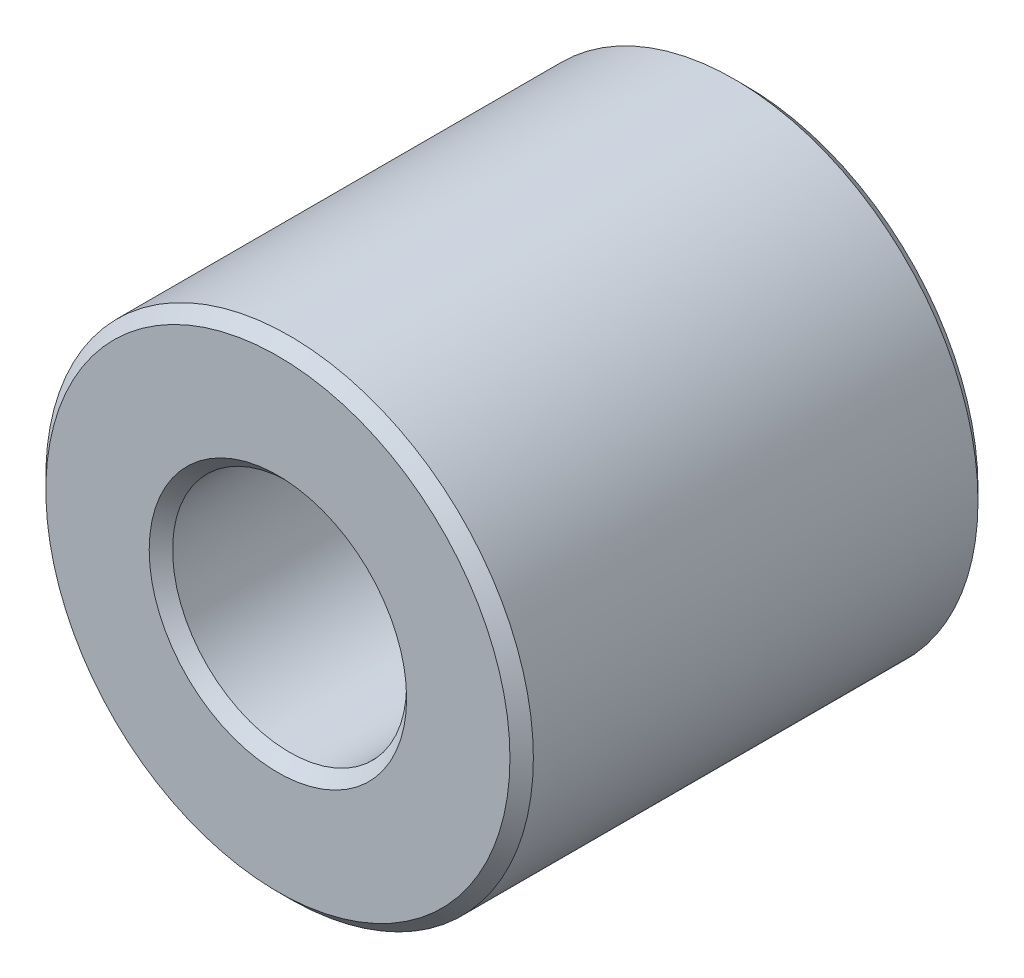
from build123d import *

# Parameters (mm, degrees)
SKETCH1_R           = 25
SKETCH1_R_2         = 12
BOSS_EXTRUDE1_DEPTH = 24
CHAMFER1_SIZE       = 1.2


with BuildPart() as part:
    # Sketch1 → Boss-Extrude1 (new, symmetric)
    with BuildSketch(Plane.XY):
        Circle(SKETCH1_R)
        Circle(SKETCH1_R_2, mode=Mode.SUBTRACT)
    extrude(amount=BOSS_EXTRUDE1_DEPTH, both=True)

    # Chamfer1
    chamfer1_edges = [part.edges().sort_by_distance(p)[0] for p in [
        (-25, 0, -24),
        (-25, 0, 24),
        (-12, 0, -24),
        (-12, 0, 24),
    ]]
    chamfer(chamfer1_edges, length=CHAMFER1_SIZE)


solid = part.part
